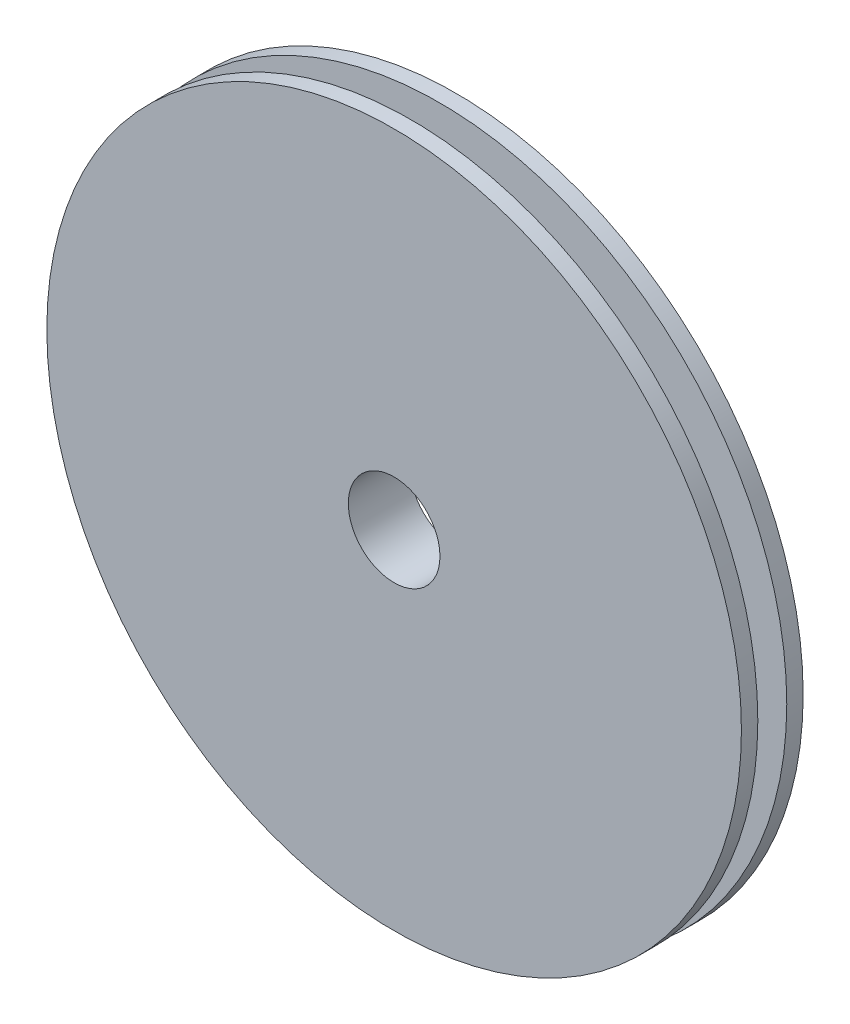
from build123d import *

# Parameters (mm, degrees)
SKETCH1_R               = 18
BOSS_EXTRUDE1_DEPTH     = 3.2
CUT_EXTRUDE1_DEPTH      = 17
CUT_EXTRUDE1_DEPTH_BACK = 43
SKETCH2_R               = 2.375
SKETCH5_R               = 18
SKETCH5_R_2             = 15.5
CUT_EXTRUDE4_DEPTH      = 0.75


with BuildPart() as part:
    # Sketch1 → Boss-Extrude1 (new body)
    with BuildSketch(Plane.XY):
        Circle(SKETCH1_R)
    extrude(amount=BOSS_EXTRUDE1_DEPTH)

    # Sketch2 → Cut-Extrude1 (cut, two sides: drawn at the far end of the back side and taken through both)
    with BuildSketch(Plane.XY.offset(3.2).offset(-CUT_EXTRUDE1_DEPTH_BACK)):
        Circle(SKETCH2_R)
    extrude(amount=CUT_EXTRUDE1_DEPTH + CUT_EXTRUDE1_DEPTH_BACK, mode=Mode.SUBTRACT)

    # Sketch5 → Cut-Extrude4 (cut, symmetric)
    with BuildSketch(Plane.XY.offset(1.6)):
        Circle(SKETCH5_R)
        Circle(SKETCH5_R_2, mode=Mode.SUBTRACT)
    extrude(amount=CUT_EXTRUDE4_DEPTH, both=True, mode=Mode.SUBTRACT)


solid = part.part
